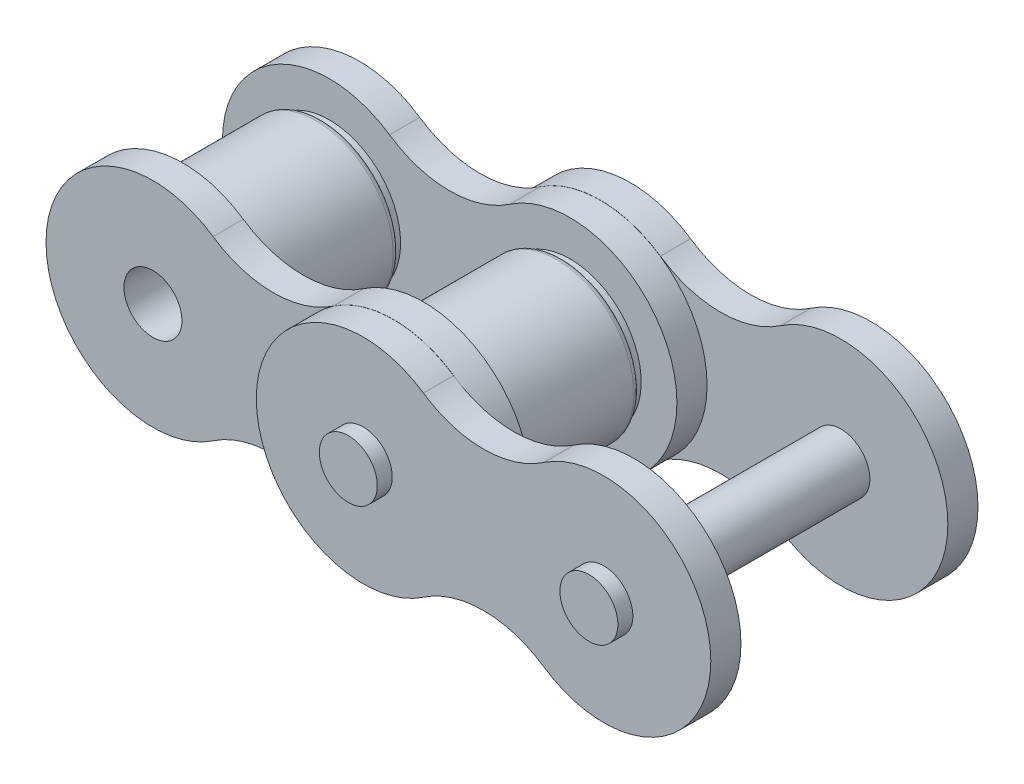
ISO-10303-21;
HEADER;
FILE_DESCRIPTION(('STEP AP214'),'2;1');
FILE_NAME('part.step','',(''),(''),'','','');
FILE_SCHEMA(('AUTOMOTIVE_DESIGN { 1 0 10303 214 1 1 1 1 }'));
ENDSEC;
DATA;
#1=APPLICATION_CONTEXT('core data for automotive mechanical design processes');
#2=APPLICATION_PROTOCOL_DEFINITION('international standard','automotive_design',2000,#1);
#3=PRODUCT_CONTEXT('',#1,'mechanical');
#4=PRODUCT('Part','Part','',(#3));
#5=PRODUCT_RELATED_PRODUCT_CATEGORY('part','',(#4));
#6=PRODUCT_DEFINITION_FORMATION('','',#4);
#7=PRODUCT_DEFINITION_CONTEXT('part definition',#1,'design');
#8=PRODUCT_DEFINITION('design','',#6,#7);
#9=PRODUCT_DEFINITION_SHAPE('','',#8);
#10=(LENGTH_UNIT() NAMED_UNIT(*) SI_UNIT(.MILLI.,.METRE.));
#11=(NAMED_UNIT(*) PLANE_ANGLE_UNIT() SI_UNIT($,.RADIAN.));
#12=(NAMED_UNIT(*) SI_UNIT($,.STERADIAN.) SOLID_ANGLE_UNIT());
#13=UNCERTAINTY_MEASURE_WITH_UNIT(LENGTH_MEASURE(1.E-05),#10,'distance_accuracy_value','');
#14=(GEOMETRIC_REPRESENTATION_CONTEXT(3) GLOBAL_UNCERTAINTY_ASSIGNED_CONTEXT((#13)) GLOBAL_UNIT_ASSIGNED_CONTEXT((#10,
#11,#12)) REPRESENTATION_CONTEXT('',''));
#15=CARTESIAN_POINT('',(0.,0.,0.));
#16=DIRECTION('',(0.,0.,1.));
#17=DIRECTION('',(1.,0.,0.));
#18=AXIS2_PLACEMENT_3D('',#15,#16,#17);
#19=CARTESIAN_POINT('',(32.70625,0.,9.8));
#20=DIRECTION('',(0.,0.,1.));
#21=DIRECTION('',(1.,0.,0.));
#22=AXIS2_PLACEMENT_3D('',#19,#20,#21);
#23=PLANE('',#22);
#24=CARTESIAN_POINT('',(31.75,0.,9.8));
#25=DIRECTION('',(0.,0.,-1.));
#26=DIRECTION('',(-1.,0.,0.));
#27=AXIS2_PLACEMENT_3D('',#24,#25,#26);
#28=CIRCLE('',#27,1.9125);
#29=CARTESIAN_POINT('',(29.8375,0.,9.8));
#30=VERTEX_POINT('',#29);
#31=EDGE_CURVE('E20',#30,#30,#28,.T.);
#32=ORIENTED_EDGE('',*,*,#31,.F.);
#33=EDGE_LOOP('',(#32));
#34=FACE_BOUND('',#33,.T.);
#35=ADVANCED_FACE('F16',(#34),#23,.T.);
#36=CARTESIAN_POINT('',(16.83125,0.,9.8));
#37=DIRECTION('',(0.,0.,1.));
#38=DIRECTION('',(1.,0.,0.));
#39=AXIS2_PLACEMENT_3D('',#36,#37,#38);
#40=PLANE('',#39);
#41=CARTESIAN_POINT('',(15.875,0.,9.8));
#42=DIRECTION('',(0.,0.,-1.));
#43=DIRECTION('',(-1.,0.,0.));
#44=AXIS2_PLACEMENT_3D('',#41,#42,#43);
#45=CIRCLE('',#44,1.9125);
#46=CARTESIAN_POINT('',(13.9625,0.,9.8));
#47=VERTEX_POINT('',#46);
#48=EDGE_CURVE('E305',#47,#47,#45,.T.);
#49=ORIENTED_EDGE('',*,*,#48,.F.);
#50=EDGE_LOOP('',(#49));
#51=FACE_BOUND('',#50,.T.);
#52=ADVANCED_FACE('F315',(#51),#40,.T.);
#53=CARTESIAN_POINT('',(31.75,0.,0.));
#54=DIRECTION('',(0.,0.,-1.));
#55=DIRECTION('',(-1.,0.,0.));
#56=AXIS2_PLACEMENT_3D('',#53,#54,#55);
#57=CYLINDRICAL_SURFACE('',#56,1.9125);
#58=CARTESIAN_POINT('',(31.75,0.,8.815));
#59=DIRECTION('',(0.,0.,-1.));
#60=DIRECTION('',(-1.,0.,0.));
#61=AXIS2_PLACEMENT_3D('',#58,#59,#60);
#62=CIRCLE('',#61,1.9125);
#63=CARTESIAN_POINT('',(29.8375,0.,8.815));
#64=VERTEX_POINT('',#63);
#65=EDGE_CURVE('E303',#64,#64,#62,.F.);
#66=ORIENTED_EDGE('',*,*,#65,.T.);
#67=EDGE_LOOP('',(#66));
#68=FACE_BOUND('',#67,.T.);
#69=ORIENTED_EDGE('',*,*,#31,.T.);
#70=EDGE_LOOP('',(#69));
#71=FACE_BOUND('',#70,.T.);
#72=ADVANCED_FACE('F312',(#68,#71),#57,.T.);
#73=CARTESIAN_POINT('',(15.875,0.,7.3125));
#74=DIRECTION('',(0.,0.,-1.));
#75=DIRECTION('',(-1.,0.,0.));
#76=AXIS2_PLACEMENT_3D('',#73,#74,#75);
#77=CYLINDRICAL_SURFACE('',#76,1.9125);
#78=ORIENTED_EDGE('',*,*,#48,.T.);
#79=EDGE_LOOP('',(#78));
#80=FACE_BOUND('',#79,.T.);
#81=CARTESIAN_POINT('',(15.875,0.,8.815));
#82=DIRECTION('',(0.,0.,-1.));
#83=DIRECTION('',(-1.,0.,0.));
#84=AXIS2_PLACEMENT_3D('',#81,#82,#83);
#85=CIRCLE('',#84,1.9125);
#86=CARTESIAN_POINT('',(13.9625,0.,8.815));
#87=VERTEX_POINT('',#86);
#88=EDGE_CURVE('E170',#87,#87,#85,.F.);
#89=ORIENTED_EDGE('',*,*,#88,.T.);
#90=EDGE_LOOP('',(#89));
#91=FACE_BOUND('',#90,.T.);
#92=ADVANCED_FACE('F657',(#80,#91),#77,.T.);
#93=CARTESIAN_POINT('',(0.,0.,8.815));
#94=DIRECTION('',(0.,0.,-1.));
#95=DIRECTION('',(-1.,0.,0.));
#96=AXIS2_PLACEMENT_3D('',#93,#94,#95);
#97=PLANE('',#96);
#98=ORIENTED_EDGE('',*,*,#88,.F.);
#99=EDGE_LOOP('',(#98));
#100=FACE_BOUND('',#99,.T.);
#101=CARTESIAN_POINT('',(15.875,0.,8.815));
#102=DIRECTION('',(0.,0.,-1.));
#103=DIRECTION('',(-1.,0.,0.));
#104=AXIS2_PLACEMENT_3D('',#101,#102,#103);
#105=CIRCLE('',#104,7.0555);
#106=CARTESIAN_POINT('',(19.84375,-5.833446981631,8.815));
#107=VERTEX_POINT('',#106);
#108=CARTESIAN_POINT('',(19.84375,5.833446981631,8.815));
#109=VERTEX_POINT('',#108);
#110=EDGE_CURVE('E127',#107,#109,#105,.T.);
#111=ORIENTED_EDGE('',*,*,#110,.F.);
#112=CARTESIAN_POINT('',(23.8125,-11.666893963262,8.815));
#113=DIRECTION('',(0.,0.,-1.));
#114=DIRECTION('',(-1.,0.,0.));
#115=AXIS2_PLACEMENT_3D('',#112,#113,#114);
#116=CIRCLE('',#115,7.05550000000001);
#117=CARTESIAN_POINT('',(27.78125,-5.833446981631,8.815));
#118=VERTEX_POINT('',#117);
#119=EDGE_CURVE('E297',#107,#118,#116,.T.);
#120=ORIENTED_EDGE('',*,*,#119,.T.);
#121=CARTESIAN_POINT('',(31.75,0.,8.815));
#122=DIRECTION('',(0.,0.,-1.));
#123=DIRECTION('',(-1.,0.,0.));
#124=AXIS2_PLACEMENT_3D('',#121,#122,#123);
#125=CIRCLE('',#124,7.0555);
#126=CARTESIAN_POINT('',(27.78125,5.833446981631,8.815));
#127=VERTEX_POINT('',#126);
#128=EDGE_CURVE('E144',#127,#118,#125,.T.);
#129=ORIENTED_EDGE('',*,*,#128,.F.);
#130=CARTESIAN_POINT('',(23.8125,11.666893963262,8.815));
#131=DIRECTION('',(0.,0.,-1.));
#132=DIRECTION('',(-1.,0.,0.));
#133=AXIS2_PLACEMENT_3D('',#130,#131,#132);
#134=CIRCLE('',#133,7.05550000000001);
#135=EDGE_CURVE('E141',#127,#109,#134,.T.);
#136=ORIENTED_EDGE('',*,*,#135,.T.);
#137=EDGE_LOOP('',(#111,#120,#129,#136));
#138=FACE_BOUND('',#137,.T.);
#139=ORIENTED_EDGE('',*,*,#65,.F.);
#140=EDGE_LOOP('',(#139));
#141=FACE_BOUND('',#140,.T.);
#142=ADVANCED_FACE('F142',(#100,#138,#141),#97,.F.);
#143=CARTESIAN_POINT('',(32.70625,0.,-9.79999999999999));
#144=DIRECTION('',(0.,0.,-1.));
#145=DIRECTION('',(-1.,0.,0.));
#146=AXIS2_PLACEMENT_3D('',#143,#144,#145);
#147=PLANE('',#146);
#148=CARTESIAN_POINT('',(31.75,0.,-9.8));
#149=DIRECTION('',(0.,0.,-1.));
#150=DIRECTION('',(-1.,0.,0.));
#151=AXIS2_PLACEMENT_3D('',#148,#149,#150);
#152=CIRCLE('',#151,1.9125);
#153=CARTESIAN_POINT('',(29.8375,0.,-9.8));
#154=VERTEX_POINT('',#153);
#155=EDGE_CURVE('E294',#154,#154,#152,.F.);
#156=ORIENTED_EDGE('',*,*,#155,.F.);
#157=EDGE_LOOP('',(#156));
#158=FACE_BOUND('',#157,.T.);
#159=ADVANCED_FACE('F641',(#158),#147,.T.);
#160=CARTESIAN_POINT('',(16.83125,0.,-9.8));
#161=DIRECTION('',(0.,0.,-1.));
#162=DIRECTION('',(-1.,0.,0.));
#163=AXIS2_PLACEMENT_3D('',#160,#161,#162);
#164=PLANE('',#163);
#165=CARTESIAN_POINT('',(15.875,0.,-9.8));
#166=DIRECTION('',(0.,0.,-1.));
#167=DIRECTION('',(-1.,0.,0.));
#168=AXIS2_PLACEMENT_3D('',#165,#166,#167);
#169=CIRCLE('',#168,1.9125);
#170=CARTESIAN_POINT('',(13.9625,0.,-9.8));
#171=VERTEX_POINT('',#170);
#172=EDGE_CURVE('E165',#171,#171,#169,.F.);
#173=ORIENTED_EDGE('',*,*,#172,.F.);
#174=EDGE_LOOP('',(#173));
#175=FACE_BOUND('',#174,.T.);
#176=ADVANCED_FACE('F633',(#175),#164,.T.);
#177=CARTESIAN_POINT('',(0.,0.,3.943));
#178=DIRECTION('',(0.,0.,1.));
#179=DIRECTION('',(-1.,0.,0.));
#180=AXIS2_PLACEMENT_3D('',#177,#178,#179);
#181=TOROIDAL_SURFACE('',#180,4.7,0.4);
#182=CARTESIAN_POINT('',(0.,0.,4.343));
#183=DIRECTION('',(0.,0.,-1.));
#184=DIRECTION('',(-1.,0.,0.));
#185=AXIS2_PLACEMENT_3D('',#182,#183,#184);
#186=CIRCLE('',#185,4.7);
#187=CARTESIAN_POINT('',(-4.7,0.,4.343));
#188=VERTEX_POINT('',#187);
#189=EDGE_CURVE('E138',#188,#188,#186,.F.);
#190=ORIENTED_EDGE('',*,*,#189,.F.);
#191=EDGE_LOOP('',(#190));
#192=FACE_BOUND('',#191,.T.);
#193=CARTESIAN_POINT('',(0.,0.,3.943));
#194=DIRECTION('',(0.,0.,-1.));
#195=DIRECTION('',(-1.,0.,0.));
#196=AXIS2_PLACEMENT_3D('',#193,#194,#195);
#197=CIRCLE('',#196,5.1);
#198=CARTESIAN_POINT('',(-5.1,0.,3.943));
#199=VERTEX_POINT('',#198);
#200=EDGE_CURVE('E162',#199,#199,#197,.T.);
#201=ORIENTED_EDGE('',*,*,#200,.F.);
#202=EDGE_LOOP('',(#201));
#203=FACE_BOUND('',#202,.T.);
#204=ADVANCED_FACE('F541',(#192,#203),#181,.T.);
#205=CARTESIAN_POINT('',(15.875,0.,3.94299999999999));
#206=DIRECTION('',(0.,0.,1.));
#207=DIRECTION('',(-1.,0.,0.));
#208=AXIS2_PLACEMENT_3D('',#205,#206,#207);
#209=TOROIDAL_SURFACE('',#208,4.7,0.400000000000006);
#210=CARTESIAN_POINT('',(15.875,0.,3.943));
#211=DIRECTION('',(0.,0.,-1.));
#212=DIRECTION('',(-1.,0.,0.));
#213=AXIS2_PLACEMENT_3D('',#210,#211,#212);
#214=CIRCLE('',#213,5.1);
#215=CARTESIAN_POINT('',(10.775,0.,3.943));
#216=VERTEX_POINT('',#215);
#217=EDGE_CURVE('E158',#216,#216,#214,.T.);
#218=ORIENTED_EDGE('',*,*,#217,.F.);
#219=EDGE_LOOP('',(#218));
#220=FACE_BOUND('',#219,.T.);
#221=CARTESIAN_POINT('',(15.875,0.,4.343));
#222=DIRECTION('',(0.,0.,-1.));
#223=DIRECTION('',(-1.,0.,0.));
#224=AXIS2_PLACEMENT_3D('',#221,#222,#223);
#225=CIRCLE('',#224,4.7);
#226=CARTESIAN_POINT('',(11.175,0.,4.343));
#227=VERTEX_POINT('',#226);
#228=EDGE_CURVE('E168',#227,#227,#225,.F.);
#229=ORIENTED_EDGE('',*,*,#228,.F.);
#230=EDGE_LOOP('',(#229));
#231=FACE_BOUND('',#230,.T.);
#232=ADVANCED_FACE('F536',(#220,#231),#209,.T.);
#233=CARTESIAN_POINT('',(15.875,0.,4.584));
#234=DIRECTION('',(0.,0.,-1.));
#235=DIRECTION('',(-1.,0.,0.));
#236=AXIS2_PLACEMENT_3D('',#233,#234,#235);
#237=CYLINDRICAL_SURFACE('',#236,4.7);
#238=CARTESIAN_POINT('',(15.875,0.,4.825));
#239=DIRECTION('',(0.,0.,-1.));
#240=DIRECTION('',(-1.,0.,0.));
#241=AXIS2_PLACEMENT_3D('',#238,#239,#240);
#242=CIRCLE('',#241,4.7);
#243=CARTESIAN_POINT('',(11.175,0.,4.825));
#244=VERTEX_POINT('',#243);
#245=EDGE_CURVE('E161',#244,#244,#242,.F.);
#246=ORIENTED_EDGE('',*,*,#245,.F.);
#247=EDGE_LOOP('',(#246));
#248=FACE_BOUND('',#247,.T.);
#249=ORIENTED_EDGE('',*,*,#228,.T.);
#250=EDGE_LOOP('',(#249));
#251=FACE_BOUND('',#250,.T.);
#252=ADVANCED_FACE('F540',(#248,#251),#237,.T.);
#253=CARTESIAN_POINT('',(0.,0.,4.584));
#254=DIRECTION('',(0.,0.,-1.));
#255=DIRECTION('',(-1.,0.,0.));
#256=AXIS2_PLACEMENT_3D('',#253,#254,#255);
#257=CYLINDRICAL_SURFACE('',#256,4.7);
#258=CARTESIAN_POINT('',(0.,0.,4.825));
#259=DIRECTION('',(0.,0.,-1.));
#260=DIRECTION('',(-1.,0.,0.));
#261=AXIS2_PLACEMENT_3D('',#258,#259,#260);
#262=CIRCLE('',#261,4.7);
#263=CARTESIAN_POINT('',(-4.7,0.,4.825));
#264=VERTEX_POINT('',#263);
#265=EDGE_CURVE('E287',#264,#264,#262,.F.);
#266=ORIENTED_EDGE('',*,*,#265,.F.);
#267=EDGE_LOOP('',(#266));
#268=FACE_BOUND('',#267,.T.);
#269=ORIENTED_EDGE('',*,*,#189,.T.);
#270=EDGE_LOOP('',(#269));
#271=FACE_BOUND('',#270,.T.);
#272=ADVANCED_FACE('F546',(#268,#271),#257,.T.);
#273=CARTESIAN_POINT('',(15.875,0.,6.825));
#274=DIRECTION('',(0.,0.,-1.));
#275=DIRECTION('',(-1.,0.,0.));
#276=AXIS2_PLACEMENT_3D('',#273,#274,#275);
#277=CYLINDRICAL_SURFACE('',#276,7.0555);
#278=DIRECTION('',(0.,0.,-1.));
#279=VECTOR('',#278,1.);
#280=CARTESIAN_POINT('',(19.84375,5.83344698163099,6.825));
#281=LINE('',#280,#279);
#282=CARTESIAN_POINT('',(19.84375,5.83344698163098,6.825));
#283=VERTEX_POINT('',#282);
#284=EDGE_CURVE('E131',#109,#283,#281,.T.);
#285=ORIENTED_EDGE('',*,*,#284,.T.);
#286=CARTESIAN_POINT('',(15.875,0.,6.825));
#287=DIRECTION('',(0.,0.,-1.));
#288=DIRECTION('',(-1.,0.,0.));
#289=AXIS2_PLACEMENT_3D('',#286,#287,#288);
#290=CIRCLE('',#289,7.0555);
#291=CARTESIAN_POINT('',(19.84375,-5.833446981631,6.825));
#292=VERTEX_POINT('',#291);
#293=EDGE_CURVE('E285',#292,#283,#290,.T.);
#294=ORIENTED_EDGE('',*,*,#293,.F.);
#295=DIRECTION('',(0.,0.,-1.));
#296=VECTOR('',#295,1.);
#297=CARTESIAN_POINT('',(19.84375,-5.83344698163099,6.825));
#298=LINE('',#297,#296);
#299=EDGE_CURVE('E134',#292,#107,#298,.F.);
#300=ORIENTED_EDGE('',*,*,#299,.T.);
#301=ORIENTED_EDGE('',*,*,#110,.T.);
#302=EDGE_LOOP('',(#285,#294,#300,#301));
#303=FACE_BOUND('',#302,.T.);
#304=ADVANCED_FACE('F129',(#303),#277,.T.);
#305=CARTESIAN_POINT('',(23.8125,11.666893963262,6.825));
#306=DIRECTION('',(0.,0.,-1.));
#307=DIRECTION('',(-1.,0.,0.));
#308=AXIS2_PLACEMENT_3D('',#305,#306,#307);
#309=CYLINDRICAL_SURFACE('',#308,7.05550000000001);
#310=DIRECTION('',(0.,0.,-1.));
#311=VECTOR('',#310,1.);
#312=CARTESIAN_POINT('',(27.78125,5.83344698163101,6.825));
#313=LINE('',#312,#311);
#314=CARTESIAN_POINT('',(27.78125,5.83344698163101,6.825));
#315=VERTEX_POINT('',#314);
#316=EDGE_CURVE('E148',#315,#127,#313,.F.);
#317=ORIENTED_EDGE('',*,*,#316,.F.);
#318=CARTESIAN_POINT('',(23.8125,11.666893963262,6.825));
#319=DIRECTION('',(0.,0.,-1.));
#320=DIRECTION('',(-1.,0.,0.));
#321=AXIS2_PLACEMENT_3D('',#318,#319,#320);
#322=CIRCLE('',#321,7.05550000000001);
#323=EDGE_CURVE('E152',#283,#315,#322,.F.);
#324=ORIENTED_EDGE('',*,*,#323,.F.);
#325=ORIENTED_EDGE('',*,*,#284,.F.);
#326=ORIENTED_EDGE('',*,*,#135,.F.);
#327=EDGE_LOOP('',(#317,#324,#325,#326));
#328=FACE_BOUND('',#327,.T.);
#329=ADVANCED_FACE('F150',(#328),#309,.F.);
#330=CARTESIAN_POINT('',(31.75,0.,6.825));
#331=DIRECTION('',(0.,0.,-1.));
#332=DIRECTION('',(-1.,0.,0.));
#333=AXIS2_PLACEMENT_3D('',#330,#331,#332);
#334=CYLINDRICAL_SURFACE('',#333,7.0555);
#335=DIRECTION('',(0.,0.,-1.));
#336=VECTOR('',#335,1.);
#337=CARTESIAN_POINT('',(27.78125,-5.83344698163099,6.825));
#338=LINE('',#337,#336);
#339=CARTESIAN_POINT('',(27.78125,-5.83344698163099,6.825));
#340=VERTEX_POINT('',#339);
#341=EDGE_CURVE('E299',#118,#340,#338,.T.);
#342=ORIENTED_EDGE('',*,*,#341,.T.);
#343=CARTESIAN_POINT('',(31.75,0.,6.825));
#344=DIRECTION('',(0.,0.,-1.));
#345=DIRECTION('',(-1.,0.,0.));
#346=AXIS2_PLACEMENT_3D('',#343,#344,#345);
#347=CIRCLE('',#346,7.0555);
#348=EDGE_CURVE('E281',#315,#340,#347,.T.);
#349=ORIENTED_EDGE('',*,*,#348,.F.);
#350=ORIENTED_EDGE('',*,*,#316,.T.);
#351=ORIENTED_EDGE('',*,*,#128,.T.);
#352=EDGE_LOOP('',(#342,#349,#350,#351));
#353=FACE_BOUND('',#352,.T.);
#354=ADVANCED_FACE('F407',(#353),#334,.T.);
#355=CARTESIAN_POINT('',(23.8125,-11.666893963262,6.825));
#356=DIRECTION('',(0.,0.,-1.));
#357=DIRECTION('',(-1.,0.,0.));
#358=AXIS2_PLACEMENT_3D('',#355,#356,#357);
#359=CYLINDRICAL_SURFACE('',#358,7.05550000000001);
#360=ORIENTED_EDGE('',*,*,#299,.F.);
#361=CARTESIAN_POINT('',(23.8125,-11.666893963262,6.825));
#362=DIRECTION('',(0.,0.,-1.));
#363=DIRECTION('',(-1.,0.,0.));
#364=AXIS2_PLACEMENT_3D('',#361,#362,#363);
#365=CIRCLE('',#364,7.05550000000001);
#366=EDGE_CURVE('E278',#340,#292,#365,.F.);
#367=ORIENTED_EDGE('',*,*,#366,.F.);
#368=ORIENTED_EDGE('',*,*,#341,.F.);
#369=ORIENTED_EDGE('',*,*,#119,.F.);
#370=EDGE_LOOP('',(#360,#367,#368,#369));
#371=FACE_BOUND('',#370,.T.);
#372=ADVANCED_FACE('F409',(#371),#359,.F.);
#373=CARTESIAN_POINT('',(31.75,0.,0.));
#374=DIRECTION('',(0.,0.,-1.));
#375=DIRECTION('',(-1.,0.,0.));
#376=AXIS2_PLACEMENT_3D('',#373,#374,#375);
#377=CYLINDRICAL_SURFACE('',#376,1.9125);
#378=ORIENTED_EDGE('',*,*,#155,.T.);
#379=EDGE_LOOP('',(#378));
#380=FACE_BOUND('',#379,.T.);
#381=CARTESIAN_POINT('',(31.75,0.,-8.815));
#382=DIRECTION('',(0.,0.,-1.));
#383=DIRECTION('',(-1.,0.,0.));
#384=AXIS2_PLACEMENT_3D('',#381,#382,#383);
#385=CIRCLE('',#384,1.9125);
#386=CARTESIAN_POINT('',(29.8375,0.,-8.815));
#387=VERTEX_POINT('',#386);
#388=EDGE_CURVE('E275',#387,#387,#385,.F.);
#389=ORIENTED_EDGE('',*,*,#388,.F.);
#390=EDGE_LOOP('',(#389));
#391=FACE_BOUND('',#390,.T.);
#392=ADVANCED_FACE('F487',(#380,#391),#377,.T.);
#393=CARTESIAN_POINT('',(15.875,0.,-7.3125));
#394=DIRECTION('',(0.,0.,-1.));
#395=DIRECTION('',(-1.,0.,0.));
#396=AXIS2_PLACEMENT_3D('',#393,#394,#395);
#397=CYLINDRICAL_SURFACE('',#396,1.9125);
#398=CARTESIAN_POINT('',(15.875,0.,-8.815));
#399=DIRECTION('',(0.,0.,-1.));
#400=DIRECTION('',(-1.,0.,0.));
#401=AXIS2_PLACEMENT_3D('',#398,#399,#400);
#402=CIRCLE('',#401,1.9125);
#403=CARTESIAN_POINT('',(13.9625,0.,-8.815));
#404=VERTEX_POINT('',#403);
#405=EDGE_CURVE('E271',#404,#404,#402,.F.);
#406=ORIENTED_EDGE('',*,*,#405,.F.);
#407=EDGE_LOOP('',(#406));
#408=FACE_BOUND('',#407,.T.);
#409=ORIENTED_EDGE('',*,*,#172,.T.);
#410=EDGE_LOOP('',(#409));
#411=FACE_BOUND('',#410,.T.);
#412=ADVANCED_FACE('F489',(#408,#411),#397,.T.);
#413=CARTESIAN_POINT('',(0.,0.,0.));
#414=DIRECTION('',(0.,0.,-1.));
#415=DIRECTION('',(-1.,0.,0.));
#416=AXIS2_PLACEMENT_3D('',#413,#414,#415);
#417=CYLINDRICAL_SURFACE('',#416,5.1);
#418=CARTESIAN_POINT('',(0.,0.,-3.943));
#419=DIRECTION('',(0.,0.,1.));
#420=DIRECTION('',(-1.,0.,0.));
#421=AXIS2_PLACEMENT_3D('',#418,#419,#420);
#422=CIRCLE('',#421,5.1);
#423=CARTESIAN_POINT('',(-5.1,0.,-3.943));
#424=VERTEX_POINT('',#423);
#425=EDGE_CURVE('E274',#424,#424,#422,.F.);
#426=ORIENTED_EDGE('',*,*,#425,.F.);
#427=EDGE_LOOP('',(#426));
#428=FACE_BOUND('',#427,.T.);
#429=ORIENTED_EDGE('',*,*,#200,.T.);
#430=EDGE_LOOP('',(#429));
#431=FACE_BOUND('',#430,.T.);
#432=ADVANCED_FACE('F497',(#428,#431),#417,.T.);
#433=CARTESIAN_POINT('',(15.875,0.,0.));
#434=DIRECTION('',(0.,0.,-1.));
#435=DIRECTION('',(-1.,0.,0.));
#436=AXIS2_PLACEMENT_3D('',#433,#434,#435);
#437=CYLINDRICAL_SURFACE('',#436,5.1);
#438=ORIENTED_EDGE('',*,*,#217,.T.);
#439=EDGE_LOOP('',(#438));
#440=FACE_BOUND('',#439,.T.);
#441=CARTESIAN_POINT('',(15.875,0.,-3.94299999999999));
#442=DIRECTION('',(0.,0.,1.));
#443=DIRECTION('',(-1.,0.,0.));
#444=AXIS2_PLACEMENT_3D('',#441,#442,#443);
#445=CIRCLE('',#444,5.10000000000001);
#446=CARTESIAN_POINT('',(10.775,0.,-3.94299999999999));
#447=VERTEX_POINT('',#446);
#448=EDGE_CURVE('E270',#447,#447,#445,.F.);
#449=ORIENTED_EDGE('',*,*,#448,.F.);
#450=EDGE_LOOP('',(#449));
#451=FACE_BOUND('',#450,.T.);
#452=ADVANCED_FACE('F505',(#440,#451),#437,.T.);
#453=CARTESIAN_POINT('',(0.,0.,4.825));
#454=DIRECTION('',(0.,0.,-1.));
#455=DIRECTION('',(-1.,0.,0.));
#456=AXIS2_PLACEMENT_3D('',#453,#454,#455);
#457=PLANE('',#456);
#458=ORIENTED_EDGE('',*,*,#265,.T.);
#459=EDGE_LOOP('',(#458));
#460=FACE_BOUND('',#459,.T.);
#461=CARTESIAN_POINT('',(15.875,0.,4.825));
#462=DIRECTION('',(0.,0.,-1.));
#463=DIRECTION('',(-1.,0.,0.));
#464=AXIS2_PLACEMENT_3D('',#461,#462,#463);
#465=CIRCLE('',#464,7.0555);
#466=CARTESIAN_POINT('',(11.90625,-5.833446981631,4.825));
#467=VERTEX_POINT('',#466);
#468=CARTESIAN_POINT('',(11.90625,5.83344698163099,4.825));
#469=VERTEX_POINT('',#468);
#470=EDGE_CURVE('E265',#467,#469,#465,.F.);
#471=ORIENTED_EDGE('',*,*,#470,.F.);
#472=CARTESIAN_POINT('',(7.9375,-11.666893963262,4.825));
#473=DIRECTION('',(0.,0.,-1.));
#474=DIRECTION('',(-1.,0.,0.));
#475=AXIS2_PLACEMENT_3D('',#472,#473,#474);
#476=CIRCLE('',#475,7.0555);
#477=CARTESIAN_POINT('',(3.96875,-5.833446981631,4.825));
#478=VERTEX_POINT('',#477);
#479=EDGE_CURVE('E261',#467,#478,#476,.F.);
#480=ORIENTED_EDGE('',*,*,#479,.T.);
#481=CARTESIAN_POINT('',(0.,0.,4.825));
#482=DIRECTION('',(0.,0.,-1.));
#483=DIRECTION('',(-1.,0.,0.));
#484=AXIS2_PLACEMENT_3D('',#481,#482,#483);
#485=CIRCLE('',#484,7.0555);
#486=CARTESIAN_POINT('',(3.96875,5.833446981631,4.825));
#487=VERTEX_POINT('',#486);
#488=EDGE_CURVE('E258',#487,#478,#485,.F.);
#489=ORIENTED_EDGE('',*,*,#488,.F.);
#490=CARTESIAN_POINT('',(7.9375,11.666893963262,4.825));
#491=DIRECTION('',(0.,0.,-1.));
#492=DIRECTION('',(-1.,0.,0.));
#493=AXIS2_PLACEMENT_3D('',#490,#491,#492);
#494=CIRCLE('',#493,7.05550000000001);
#495=EDGE_CURVE('E254',#487,#469,#494,.F.);
#496=ORIENTED_EDGE('',*,*,#495,.T.);
#497=EDGE_LOOP('',(#471,#480,#489,#496));
#498=FACE_BOUND('',#497,.T.);
#499=ORIENTED_EDGE('',*,*,#245,.T.);
#500=EDGE_LOOP('',(#499));
#501=FACE_BOUND('',#500,.T.);
#502=ADVANCED_FACE('F415',(#460,#498,#501),#457,.T.);
#503=CARTESIAN_POINT('',(0.,0.,6.825));
#504=DIRECTION('',(0.,0.,-1.));
#505=DIRECTION('',(-1.,0.,0.));
#506=AXIS2_PLACEMENT_3D('',#503,#504,#505);
#507=PLANE('',#506);
#508=CARTESIAN_POINT('',(15.875,0.,6.825));
#509=DIRECTION('',(0.,0.,-1.));
#510=DIRECTION('',(-1.,0.,0.));
#511=AXIS2_PLACEMENT_3D('',#508,#509,#510);
#512=CIRCLE('',#511,1.9125);
#513=CARTESIAN_POINT('',(13.9625,0.,6.825));
#514=VERTEX_POINT('',#513);
#515=EDGE_CURVE('E267',#514,#514,#512,.T.);
#516=ORIENTED_EDGE('',*,*,#515,.F.);
#517=EDGE_LOOP('',(#516));
#518=FACE_BOUND('',#517,.T.);
#519=ORIENTED_EDGE('',*,*,#348,.T.);
#520=ORIENTED_EDGE('',*,*,#366,.T.);
#521=ORIENTED_EDGE('',*,*,#293,.T.);
#522=ORIENTED_EDGE('',*,*,#323,.T.);
#523=EDGE_LOOP('',(#519,#520,#521,#522));
#524=FACE_BOUND('',#523,.T.);
#525=CARTESIAN_POINT('',(31.75,0.,6.825));
#526=DIRECTION('',(0.,0.,-1.));
#527=DIRECTION('',(-1.,0.,0.));
#528=AXIS2_PLACEMENT_3D('',#525,#526,#527);
#529=CIRCLE('',#528,1.9125);
#530=CARTESIAN_POINT('',(29.8375,0.,6.825));
#531=VERTEX_POINT('',#530);
#532=EDGE_CURVE('E250',#531,#531,#529,.T.);
#533=ORIENTED_EDGE('',*,*,#532,.F.);
#534=EDGE_LOOP('',(#533));
#535=FACE_BOUND('',#534,.T.);
#536=ADVANCED_FACE('F411',(#518,#524,#535),#507,.T.);
#537=CARTESIAN_POINT('',(0.,0.,-8.815));
#538=DIRECTION('',(0.,0.,-1.));
#539=DIRECTION('',(-1.,0.,0.));
#540=AXIS2_PLACEMENT_3D('',#537,#538,#539);
#541=PLANE('',#540);
#542=ORIENTED_EDGE('',*,*,#405,.T.);
#543=EDGE_LOOP('',(#542));
#544=FACE_BOUND('',#543,.T.);
#545=CARTESIAN_POINT('',(23.8125,11.666893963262,-8.815));
#546=DIRECTION('',(0.,0.,1.));
#547=DIRECTION('',(1.,0.,0.));
#548=AXIS2_PLACEMENT_3D('',#545,#546,#547);
#549=CIRCLE('',#548,7.05550000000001);
#550=CARTESIAN_POINT('',(19.84375,5.833446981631,-8.815));
#551=VERTEX_POINT('',#550);
#552=CARTESIAN_POINT('',(27.78125,5.833446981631,-8.815));
#553=VERTEX_POINT('',#552);
#554=EDGE_CURVE('E246',#551,#553,#549,.T.);
#555=ORIENTED_EDGE('',*,*,#554,.T.);
#556=CARTESIAN_POINT('',(31.75,0.,-8.815));
#557=DIRECTION('',(0.,0.,1.));
#558=DIRECTION('',(1.,0.,0.));
#559=AXIS2_PLACEMENT_3D('',#556,#557,#558);
#560=CIRCLE('',#559,7.0555);
#561=CARTESIAN_POINT('',(27.78125,-5.833446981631,-8.815));
#562=VERTEX_POINT('',#561);
#563=EDGE_CURVE('E243',#562,#553,#560,.T.);
#564=ORIENTED_EDGE('',*,*,#563,.F.);
#565=CARTESIAN_POINT('',(23.8125,-11.666893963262,-8.815));
#566=DIRECTION('',(0.,0.,1.));
#567=DIRECTION('',(1.,0.,0.));
#568=AXIS2_PLACEMENT_3D('',#565,#566,#567);
#569=CIRCLE('',#568,7.05550000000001);
#570=CARTESIAN_POINT('',(19.84375,-5.833446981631,-8.815));
#571=VERTEX_POINT('',#570);
#572=EDGE_CURVE('E240',#562,#571,#569,.T.);
#573=ORIENTED_EDGE('',*,*,#572,.T.);
#574=CARTESIAN_POINT('',(15.875,0.,-8.815));
#575=DIRECTION('',(0.,0.,1.));
#576=DIRECTION('',(1.,0.,0.));
#577=AXIS2_PLACEMENT_3D('',#574,#575,#576);
#578=CIRCLE('',#577,7.0555);
#579=EDGE_CURVE('E236',#551,#571,#578,.T.);
#580=ORIENTED_EDGE('',*,*,#579,.F.);
#581=EDGE_LOOP('',(#555,#564,#573,#580));
#582=FACE_BOUND('',#581,.T.);
#583=ORIENTED_EDGE('',*,*,#388,.T.);
#584=EDGE_LOOP('',(#583));
#585=FACE_BOUND('',#584,.T.);
#586=ADVANCED_FACE('F414',(#544,#582,#585),#541,.T.);
#587=CARTESIAN_POINT('',(0.,0.,-3.943));
#588=DIRECTION('',(0.,0.,1.));
#589=DIRECTION('',(-1.,0.,0.));
#590=AXIS2_PLACEMENT_3D('',#587,#588,#589);
#591=TOROIDAL_SURFACE('',#590,4.7,0.4);
#592=ORIENTED_EDGE('',*,*,#425,.T.);
#593=EDGE_LOOP('',(#592));
#594=FACE_BOUND('',#593,.T.);
#595=CARTESIAN_POINT('',(0.,0.,-4.343));
#596=DIRECTION('',(0.,0.,-1.));
#597=DIRECTION('',(-1.,0.,0.));
#598=AXIS2_PLACEMENT_3D('',#595,#596,#597);
#599=CIRCLE('',#598,4.7);
#600=CARTESIAN_POINT('',(-4.7,0.,-4.343));
#601=VERTEX_POINT('',#600);
#602=EDGE_CURVE('E381',#601,#601,#599,.T.);
#603=ORIENTED_EDGE('',*,*,#602,.F.);
#604=EDGE_LOOP('',(#603));
#605=FACE_BOUND('',#604,.T.);
#606=ADVANCED_FACE('F482',(#594,#605),#591,.T.);
#607=CARTESIAN_POINT('',(15.875,0.,-3.94299999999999));
#608=DIRECTION('',(0.,0.,1.));
#609=DIRECTION('',(-1.,0.,0.));
#610=AXIS2_PLACEMENT_3D('',#607,#608,#609);
#611=TOROIDAL_SURFACE('',#610,4.7,0.400000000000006);
#612=CARTESIAN_POINT('',(15.875,0.,-4.343));
#613=DIRECTION('',(0.,0.,-1.));
#614=DIRECTION('',(-1.,0.,0.));
#615=AXIS2_PLACEMENT_3D('',#612,#613,#614);
#616=CIRCLE('',#615,4.7);
#617=CARTESIAN_POINT('',(11.175,0.,-4.343));
#618=VERTEX_POINT('',#617);
#619=EDGE_CURVE('E235',#618,#618,#616,.T.);
#620=ORIENTED_EDGE('',*,*,#619,.F.);
#621=EDGE_LOOP('',(#620));
#622=FACE_BOUND('',#621,.T.);
#623=ORIENTED_EDGE('',*,*,#448,.T.);
#624=EDGE_LOOP('',(#623));
#625=FACE_BOUND('',#624,.T.);
#626=ADVANCED_FACE('F516',(#622,#625),#611,.T.);
#627=CARTESIAN_POINT('',(15.875,0.,7.3125));
#628=DIRECTION('',(0.,0.,-1.));
#629=DIRECTION('',(-1.,0.,0.));
#630=AXIS2_PLACEMENT_3D('',#627,#628,#629);
#631=CYLINDRICAL_SURFACE('',#630,1.9125);
#632=CARTESIAN_POINT('',(15.875,0.,6.815));
#633=DIRECTION('',(0.,0.,-1.));
#634=DIRECTION('',(-1.,0.,0.));
#635=AXIS2_PLACEMENT_3D('',#632,#633,#634);
#636=CIRCLE('',#635,1.9125);
#637=CARTESIAN_POINT('',(13.9625,0.,6.815));
#638=VERTEX_POINT('',#637);
#639=EDGE_CURVE('E232',#638,#638,#636,.F.);
#640=ORIENTED_EDGE('',*,*,#639,.T.);
#641=EDGE_LOOP('',(#640));
#642=FACE_BOUND('',#641,.T.);
#643=ORIENTED_EDGE('',*,*,#515,.T.);
#644=EDGE_LOOP('',(#643));
#645=FACE_BOUND('',#644,.T.);
#646=ADVANCED_FACE('F788',(#642,#645),#631,.T.);
#647=CARTESIAN_POINT('',(15.875,0.,4.825));
#648=DIRECTION('',(0.,0.,-1.));
#649=DIRECTION('',(-1.,0.,0.));
#650=AXIS2_PLACEMENT_3D('',#647,#648,#649);
#651=CYLINDRICAL_SURFACE('',#650,7.0555);
#652=DIRECTION('',(0.,0.,-1.));
#653=VECTOR('',#652,1.);
#654=CARTESIAN_POINT('',(11.90625,-5.833446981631,4.825));
#655=LINE('',#654,#653);
#656=CARTESIAN_POINT('',(11.90625,-5.833446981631,6.815));
#657=VERTEX_POINT('',#656);
#658=EDGE_CURVE('E264',#657,#467,#655,.T.);
#659=ORIENTED_EDGE('',*,*,#658,.T.);
#660=ORIENTED_EDGE('',*,*,#470,.T.);
#661=DIRECTION('',(0.,0.,-1.));
#662=VECTOR('',#661,1.);
#663=CARTESIAN_POINT('',(11.90625,5.83344698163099,4.825));
#664=LINE('',#663,#662);
#665=CARTESIAN_POINT('',(11.90625,5.83344698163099,6.815));
#666=VERTEX_POINT('',#665);
#667=EDGE_CURVE('E253',#469,#666,#664,.F.);
#668=ORIENTED_EDGE('',*,*,#667,.T.);
#669=CARTESIAN_POINT('',(15.875,0.,6.815));
#670=DIRECTION('',(0.,0.,-1.));
#671=DIRECTION('',(-1.,0.,0.));
#672=AXIS2_PLACEMENT_3D('',#669,#670,#671);
#673=CIRCLE('',#672,7.0555);
#674=EDGE_CURVE('E230',#666,#657,#673,.T.);
#675=ORIENTED_EDGE('',*,*,#674,.T.);
#676=EDGE_LOOP('',(#659,#660,#668,#675));
#677=FACE_BOUND('',#676,.T.);
#678=ADVANCED_FACE('F779',(#677),#651,.T.);
#679=CARTESIAN_POINT('',(7.9375,-11.666893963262,4.825));
#680=DIRECTION('',(0.,0.,-1.));
#681=DIRECTION('',(-1.,0.,0.));
#682=AXIS2_PLACEMENT_3D('',#679,#680,#681);
#683=CYLINDRICAL_SURFACE('',#682,7.0555);
#684=DIRECTION('',(0.,0.,-1.));
#685=VECTOR('',#684,1.);
#686=CARTESIAN_POINT('',(3.96875,-5.83344698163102,4.825));
#687=LINE('',#686,#685);
#688=CARTESIAN_POINT('',(3.96875,-5.833446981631,6.815));
#689=VERTEX_POINT('',#688);
#690=EDGE_CURVE('E260',#478,#689,#687,.F.);
#691=ORIENTED_EDGE('',*,*,#690,.F.);
#692=ORIENTED_EDGE('',*,*,#479,.F.);
#693=ORIENTED_EDGE('',*,*,#658,.F.);
#694=CARTESIAN_POINT('',(7.9375,-11.666893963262,6.815));
#695=DIRECTION('',(0.,0.,-1.));
#696=DIRECTION('',(-1.,0.,0.));
#697=AXIS2_PLACEMENT_3D('',#694,#695,#696);
#698=CIRCLE('',#697,7.0555);
#699=EDGE_CURVE('E227',#657,#689,#698,.F.);
#700=ORIENTED_EDGE('',*,*,#699,.T.);
#701=EDGE_LOOP('',(#691,#692,#693,#700));
#702=FACE_BOUND('',#701,.T.);
#703=ADVANCED_FACE('F772',(#702),#683,.F.);
#704=CARTESIAN_POINT('',(0.,0.,4.825));
#705=DIRECTION('',(0.,0.,-1.));
#706=DIRECTION('',(-1.,0.,0.));
#707=AXIS2_PLACEMENT_3D('',#704,#705,#706);
#708=CYLINDRICAL_SURFACE('',#707,7.0555);
#709=DIRECTION('',(0.,0.,-1.));
#710=VECTOR('',#709,1.);
#711=CARTESIAN_POINT('',(3.96874999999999,5.83344698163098,4.825));
#712=LINE('',#711,#710);
#713=CARTESIAN_POINT('',(3.96875,5.833446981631,6.815));
#714=VERTEX_POINT('',#713);
#715=EDGE_CURVE('E257',#714,#487,#712,.T.);
#716=ORIENTED_EDGE('',*,*,#715,.T.);
#717=ORIENTED_EDGE('',*,*,#488,.T.);
#718=ORIENTED_EDGE('',*,*,#690,.T.);
#719=CARTESIAN_POINT('',(0.,0.,6.815));
#720=DIRECTION('',(0.,0.,-1.));
#721=DIRECTION('',(-1.,0.,0.));
#722=AXIS2_PLACEMENT_3D('',#719,#720,#721);
#723=CIRCLE('',#722,7.0555);
#724=EDGE_CURVE('E225',#689,#714,#723,.T.);
#725=ORIENTED_EDGE('',*,*,#724,.T.);
#726=EDGE_LOOP('',(#716,#717,#718,#725));
#727=FACE_BOUND('',#726,.T.);
#728=ADVANCED_FACE('F434',(#727),#708,.T.);
#729=CARTESIAN_POINT('',(7.9375,11.666893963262,4.825));
#730=DIRECTION('',(0.,0.,-1.));
#731=DIRECTION('',(-1.,0.,0.));
#732=AXIS2_PLACEMENT_3D('',#729,#730,#731);
#733=CYLINDRICAL_SURFACE('',#732,7.05550000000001);
#734=ORIENTED_EDGE('',*,*,#667,.F.);
#735=ORIENTED_EDGE('',*,*,#495,.F.);
#736=ORIENTED_EDGE('',*,*,#715,.F.);
#737=CARTESIAN_POINT('',(7.9375,11.666893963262,6.815));
#738=DIRECTION('',(0.,0.,-1.));
#739=DIRECTION('',(-1.,0.,0.));
#740=AXIS2_PLACEMENT_3D('',#737,#738,#739);
#741=CIRCLE('',#740,7.05550000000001);
#742=EDGE_CURVE('E222',#714,#666,#741,.F.);
#743=ORIENTED_EDGE('',*,*,#742,.T.);
#744=EDGE_LOOP('',(#734,#735,#736,#743));
#745=FACE_BOUND('',#744,.T.);
#746=ADVANCED_FACE('F423',(#745),#733,.F.);
#747=CARTESIAN_POINT('',(31.75,0.,0.));
#748=DIRECTION('',(0.,0.,-1.));
#749=DIRECTION('',(-1.,0.,0.));
#750=AXIS2_PLACEMENT_3D('',#747,#748,#749);
#751=CYLINDRICAL_SURFACE('',#750,1.9125);
#752=CARTESIAN_POINT('',(31.75,0.,-6.825));
#753=DIRECTION('',(0.,0.,-1.));
#754=DIRECTION('',(-1.,0.,0.));
#755=AXIS2_PLACEMENT_3D('',#752,#753,#754);
#756=CIRCLE('',#755,1.9125);
#757=CARTESIAN_POINT('',(29.8375,0.,-6.825));
#758=VERTEX_POINT('',#757);
#759=EDGE_CURVE('E219',#758,#758,#756,.F.);
#760=ORIENTED_EDGE('',*,*,#759,.T.);
#761=EDGE_LOOP('',(#760));
#762=FACE_BOUND('',#761,.T.);
#763=ORIENTED_EDGE('',*,*,#532,.T.);
#764=EDGE_LOOP('',(#763));
#765=FACE_BOUND('',#764,.T.);
#766=ADVANCED_FACE('F420',(#762,#765),#751,.T.);
#767=CARTESIAN_POINT('',(23.8125,11.666893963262,-6.825));
#768=DIRECTION('',(0.,0.,1.));
#769=DIRECTION('',(1.,0.,0.));
#770=AXIS2_PLACEMENT_3D('',#767,#768,#769);
#771=CYLINDRICAL_SURFACE('',#770,7.05550000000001);
#772=DIRECTION('',(0.,0.,1.));
#773=VECTOR('',#772,1.);
#774=CARTESIAN_POINT('',(19.84375,5.83344698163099,-6.825));
#775=LINE('',#774,#773);
#776=CARTESIAN_POINT('',(19.84375,5.833446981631,-6.825));
#777=VERTEX_POINT('',#776);
#778=EDGE_CURVE('E249',#777,#551,#775,.F.);
#779=ORIENTED_EDGE('',*,*,#778,.F.);
#780=CARTESIAN_POINT('',(23.8125,11.666893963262,-6.825));
#781=DIRECTION('',(0.,0.,1.));
#782=DIRECTION('',(1.,0.,0.));
#783=AXIS2_PLACEMENT_3D('',#780,#781,#782);
#784=CIRCLE('',#783,7.05550000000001);
#785=CARTESIAN_POINT('',(27.78125,5.833446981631,-6.825));
#786=VERTEX_POINT('',#785);
#787=EDGE_CURVE('E216',#777,#786,#784,.T.);
#788=ORIENTED_EDGE('',*,*,#787,.T.);
#789=DIRECTION('',(0.,0.,1.));
#790=VECTOR('',#789,1.);
#791=CARTESIAN_POINT('',(27.78125,5.83344698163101,-6.825));
#792=LINE('',#791,#790);
#793=EDGE_CURVE('E245',#553,#786,#792,.T.);
#794=ORIENTED_EDGE('',*,*,#793,.F.);
#795=ORIENTED_EDGE('',*,*,#554,.F.);
#796=EDGE_LOOP('',(#779,#788,#794,#795));
#797=FACE_BOUND('',#796,.T.);
#798=ADVANCED_FACE('F422',(#797),#771,.F.);
#799=CARTESIAN_POINT('',(31.75,0.,-6.825));
#800=DIRECTION('',(0.,0.,1.));
#801=DIRECTION('',(1.,0.,0.));
#802=AXIS2_PLACEMENT_3D('',#799,#800,#801);
#803=CYLINDRICAL_SURFACE('',#802,7.0555);
#804=DIRECTION('',(0.,0.,1.));
#805=VECTOR('',#804,1.);
#806=CARTESIAN_POINT('',(27.78125,-5.83344698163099,-6.825));
#807=LINE('',#806,#805);
#808=CARTESIAN_POINT('',(27.78125,-5.833446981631,-6.825));
#809=VERTEX_POINT('',#808);
#810=EDGE_CURVE('E242',#809,#562,#807,.F.);
#811=ORIENTED_EDGE('',*,*,#810,.T.);
#812=ORIENTED_EDGE('',*,*,#563,.T.);
#813=ORIENTED_EDGE('',*,*,#793,.T.);
#814=CARTESIAN_POINT('',(31.75,0.,-6.825));
#815=DIRECTION('',(0.,0.,1.));
#816=DIRECTION('',(1.,0.,0.));
#817=AXIS2_PLACEMENT_3D('',#814,#815,#816);
#818=CIRCLE('',#817,7.0555);
#819=EDGE_CURVE('E214',#786,#809,#818,.F.);
#820=ORIENTED_EDGE('',*,*,#819,.T.);
#821=EDGE_LOOP('',(#811,#812,#813,#820));
#822=FACE_BOUND('',#821,.T.);
#823=ADVANCED_FACE('F431',(#822),#803,.T.);
#824=CARTESIAN_POINT('',(23.8125,-11.666893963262,-6.825));
#825=DIRECTION('',(0.,0.,1.));
#826=DIRECTION('',(1.,0.,0.));
#827=AXIS2_PLACEMENT_3D('',#824,#825,#826);
#828=CYLINDRICAL_SURFACE('',#827,7.05550000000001);
#829=ORIENTED_EDGE('',*,*,#810,.F.);
#830=CARTESIAN_POINT('',(23.8125,-11.666893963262,-6.825));
#831=DIRECTION('',(0.,0.,1.));
#832=DIRECTION('',(1.,0.,0.));
#833=AXIS2_PLACEMENT_3D('',#830,#831,#832);
#834=CIRCLE('',#833,7.05550000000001);
#835=CARTESIAN_POINT('',(19.84375,-5.833446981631,-6.825));
#836=VERTEX_POINT('',#835);
#837=EDGE_CURVE('E212',#809,#836,#834,.T.);
#838=ORIENTED_EDGE('',*,*,#837,.T.);
#839=DIRECTION('',(0.,0.,1.));
#840=VECTOR('',#839,1.);
#841=CARTESIAN_POINT('',(19.84375,-5.83344698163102,-6.825));
#842=LINE('',#841,#840);
#843=EDGE_CURVE('E239',#571,#836,#842,.T.);
#844=ORIENTED_EDGE('',*,*,#843,.F.);
#845=ORIENTED_EDGE('',*,*,#572,.F.);
#846=EDGE_LOOP('',(#829,#838,#844,#845));
#847=FACE_BOUND('',#846,.T.);
#848=ADVANCED_FACE('F441',(#847),#828,.F.);
#849=CARTESIAN_POINT('',(15.875,0.,-6.825));
#850=DIRECTION('',(0.,0.,1.));
#851=DIRECTION('',(1.,0.,0.));
#852=AXIS2_PLACEMENT_3D('',#849,#850,#851);
#853=CYLINDRICAL_SURFACE('',#852,7.0555);
#854=ORIENTED_EDGE('',*,*,#843,.T.);
#855=CARTESIAN_POINT('',(15.875,0.,-6.825));
#856=DIRECTION('',(0.,0.,1.));
#857=DIRECTION('',(1.,0.,0.));
#858=AXIS2_PLACEMENT_3D('',#855,#856,#857);
#859=CIRCLE('',#858,7.0555);
#860=EDGE_CURVE('E210',#836,#777,#859,.F.);
#861=ORIENTED_EDGE('',*,*,#860,.T.);
#862=ORIENTED_EDGE('',*,*,#778,.T.);
#863=ORIENTED_EDGE('',*,*,#579,.T.);
#864=EDGE_LOOP('',(#854,#861,#862,#863));
#865=FACE_BOUND('',#864,.T.);
#866=ADVANCED_FACE('F445',(#865),#853,.T.);
#867=CARTESIAN_POINT('',(0.,0.,-4.584));
#868=DIRECTION('',(0.,0.,-1.));
#869=DIRECTION('',(-1.,0.,0.));
#870=AXIS2_PLACEMENT_3D('',#867,#868,#869);
#871=CYLINDRICAL_SURFACE('',#870,4.7);
#872=CARTESIAN_POINT('',(0.,0.,-4.825));
#873=DIRECTION('',(0.,0.,-1.));
#874=DIRECTION('',(-1.,0.,0.));
#875=AXIS2_PLACEMENT_3D('',#872,#873,#874);
#876=CIRCLE('',#875,4.7);
#877=CARTESIAN_POINT('',(-4.7,0.,-4.825));
#878=VERTEX_POINT('',#877);
#879=EDGE_CURVE('E207',#878,#878,#876,.F.);
#880=ORIENTED_EDGE('',*,*,#879,.T.);
#881=EDGE_LOOP('',(#880));
#882=FACE_BOUND('',#881,.T.);
#883=ORIENTED_EDGE('',*,*,#602,.T.);
#884=EDGE_LOOP('',(#883));
#885=FACE_BOUND('',#884,.T.);
#886=ADVANCED_FACE('F449',(#882,#885),#871,.T.);
#887=CARTESIAN_POINT('',(15.875,0.,-4.584));
#888=DIRECTION('',(0.,0.,-1.));
#889=DIRECTION('',(-1.,0.,0.));
#890=AXIS2_PLACEMENT_3D('',#887,#888,#889);
#891=CYLINDRICAL_SURFACE('',#890,4.7);
#892=ORIENTED_EDGE('',*,*,#619,.T.);
#893=EDGE_LOOP('',(#892));
#894=FACE_BOUND('',#893,.T.);
#895=CARTESIAN_POINT('',(15.875,0.,-4.825));
#896=DIRECTION('',(0.,0.,-1.));
#897=DIRECTION('',(-1.,0.,0.));
#898=AXIS2_PLACEMENT_3D('',#895,#896,#897);
#899=CIRCLE('',#898,4.7);
#900=CARTESIAN_POINT('',(11.175,0.,-4.825));
#901=VERTEX_POINT('',#900);
#902=EDGE_CURVE('E204',#901,#901,#899,.F.);
#903=ORIENTED_EDGE('',*,*,#902,.T.);
#904=EDGE_LOOP('',(#903));
#905=FACE_BOUND('',#904,.T.);
#906=ADVANCED_FACE('F453',(#894,#905),#891,.T.);
#907=CARTESIAN_POINT('',(0.,0.,6.815));
#908=DIRECTION('',(0.,0.,-1.));
#909=DIRECTION('',(-1.,0.,0.));
#910=AXIS2_PLACEMENT_3D('',#907,#908,#909);
#911=PLANE('',#910);
#912=ORIENTED_EDGE('',*,*,#724,.F.);
#913=ORIENTED_EDGE('',*,*,#699,.F.);
#914=ORIENTED_EDGE('',*,*,#674,.F.);
#915=ORIENTED_EDGE('',*,*,#742,.F.);
#916=EDGE_LOOP('',(#912,#913,#914,#915));
#917=FACE_BOUND('',#916,.T.);
#918=ORIENTED_EDGE('',*,*,#639,.F.);
#919=EDGE_LOOP('',(#918));
#920=FACE_BOUND('',#919,.T.);
#921=CARTESIAN_POINT('',(0.,0.,6.815));
#922=DIRECTION('',(0.,0.,-1.));
#923=DIRECTION('',(-1.,0.,0.));
#924=AXIS2_PLACEMENT_3D('',#921,#922,#923);
#925=CIRCLE('',#924,1.9125);
#926=CARTESIAN_POINT('',(-1.9125,0.,6.815));
#927=VERTEX_POINT('',#926);
#928=EDGE_CURVE('E201',#927,#927,#925,.T.);
#929=ORIENTED_EDGE('',*,*,#928,.T.);
#930=EDGE_LOOP('',(#929));
#931=FACE_BOUND('',#930,.T.);
#932=ADVANCED_FACE('F457',(#917,#920,#931),#911,.F.);
#933=CARTESIAN_POINT('',(0.,0.,-6.825));
#934=DIRECTION('',(0.,0.,-1.));
#935=DIRECTION('',(-1.,0.,0.));
#936=AXIS2_PLACEMENT_3D('',#933,#934,#935);
#937=PLANE('',#936);
#938=CARTESIAN_POINT('',(15.875,0.,-6.825));
#939=DIRECTION('',(0.,0.,-1.));
#940=DIRECTION('',(-1.,0.,0.));
#941=AXIS2_PLACEMENT_3D('',#938,#939,#940);
#942=CIRCLE('',#941,1.9125);
#943=CARTESIAN_POINT('',(13.9625,0.,-6.825));
#944=VERTEX_POINT('',#943);
#945=EDGE_CURVE('E198',#944,#944,#942,.F.);
#946=ORIENTED_EDGE('',*,*,#945,.F.);
#947=EDGE_LOOP('',(#946));
#948=FACE_BOUND('',#947,.T.);
#949=ORIENTED_EDGE('',*,*,#837,.F.);
#950=ORIENTED_EDGE('',*,*,#819,.F.);
#951=ORIENTED_EDGE('',*,*,#787,.F.);
#952=ORIENTED_EDGE('',*,*,#860,.F.);
#953=EDGE_LOOP('',(#949,#950,#951,#952));
#954=FACE_BOUND('',#953,.T.);
#955=ORIENTED_EDGE('',*,*,#759,.F.);
#956=EDGE_LOOP('',(#955));
#957=FACE_BOUND('',#956,.T.);
#958=ADVANCED_FACE('F353',(#948,#954,#957),#937,.F.);
#959=CARTESIAN_POINT('',(0.,0.,-4.825));
#960=DIRECTION('',(0.,0.,-1.));
#961=DIRECTION('',(-1.,0.,0.));
#962=AXIS2_PLACEMENT_3D('',#959,#960,#961);
#963=PLANE('',#962);
#964=ORIENTED_EDGE('',*,*,#902,.F.);
#965=EDGE_LOOP('',(#964));
#966=FACE_BOUND('',#965,.T.);
#967=CARTESIAN_POINT('',(7.9375,-11.666893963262,-4.825));
#968=DIRECTION('',(0.,0.,1.));
#969=DIRECTION('',(1.,0.,0.));
#970=AXIS2_PLACEMENT_3D('',#967,#968,#969);
#971=CIRCLE('',#970,7.0555);
#972=CARTESIAN_POINT('',(3.96875,-5.833446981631,-4.825));
#973=VERTEX_POINT('',#972);
#974=CARTESIAN_POINT('',(11.90625,-5.833446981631,-4.825));
#975=VERTEX_POINT('',#974);
#976=EDGE_CURVE('E196',#973,#975,#971,.F.);
#977=ORIENTED_EDGE('',*,*,#976,.T.);
#978=CARTESIAN_POINT('',(15.875,0.,-4.825));
#979=DIRECTION('',(0.,0.,1.));
#980=DIRECTION('',(1.,0.,0.));
#981=AXIS2_PLACEMENT_3D('',#978,#979,#980);
#982=CIRCLE('',#981,7.0555);
#983=CARTESIAN_POINT('',(11.90625,5.833446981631,-4.825));
#984=VERTEX_POINT('',#983);
#985=EDGE_CURVE('E186',#984,#975,#982,.F.);
#986=ORIENTED_EDGE('',*,*,#985,.F.);
#987=CARTESIAN_POINT('',(7.9375,11.666893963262,-4.825));
#988=DIRECTION('',(0.,0.,1.));
#989=DIRECTION('',(1.,0.,0.));
#990=AXIS2_PLACEMENT_3D('',#987,#988,#989);
#991=CIRCLE('',#990,7.05550000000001);
#992=CARTESIAN_POINT('',(3.96874999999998,5.83344698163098,-4.825));
#993=VERTEX_POINT('',#992);
#994=EDGE_CURVE('E189',#984,#993,#991,.F.);
#995=ORIENTED_EDGE('',*,*,#994,.T.);
#996=CARTESIAN_POINT('',(0.,0.,-4.825));
#997=DIRECTION('',(0.,0.,1.));
#998=DIRECTION('',(1.,0.,0.));
#999=AXIS2_PLACEMENT_3D('',#996,#997,#998);
#1000=CIRCLE('',#999,7.0555);
#1001=EDGE_CURVE('E192',#973,#993,#1000,.F.);
#1002=ORIENTED_EDGE('',*,*,#1001,.F.);
#1003=EDGE_LOOP('',(#977,#986,#995,#1002));
#1004=FACE_BOUND('',#1003,.T.);
#1005=ORIENTED_EDGE('',*,*,#879,.F.);
#1006=EDGE_LOOP('',(#1005));
#1007=FACE_BOUND('',#1006,.T.);
#1008=ADVANCED_FACE('F342',(#966,#1004,#1007),#963,.F.);
#1009=CARTESIAN_POINT('',(0.,0.,0.));
#1010=DIRECTION('',(0.,0.,-1.));
#1011=DIRECTION('',(-1.,0.,0.));
#1012=AXIS2_PLACEMENT_3D('',#1009,#1010,#1011);
#1013=CYLINDRICAL_SURFACE('',#1012,1.9125);
#1014=ORIENTED_EDGE('',*,*,#928,.F.);
#1015=EDGE_LOOP('',(#1014));
#1016=FACE_BOUND('',#1015,.T.);
#1017=CARTESIAN_POINT('',(0.,0.,-6.815));
#1018=DIRECTION('',(0.,0.,-1.));
#1019=DIRECTION('',(-1.,0.,0.));
#1020=AXIS2_PLACEMENT_3D('',#1017,#1018,#1019);
#1021=CIRCLE('',#1020,1.9125);
#1022=CARTESIAN_POINT('',(-1.9125,0.,-6.815));
#1023=VERTEX_POINT('',#1022);
#1024=EDGE_CURVE('E182',#1023,#1023,#1021,.F.);
#1025=ORIENTED_EDGE('',*,*,#1024,.F.);
#1026=EDGE_LOOP('',(#1025));
#1027=FACE_BOUND('',#1026,.T.);
#1028=ADVANCED_FACE('F339',(#1016,#1027),#1013,.F.);
#1029=CARTESIAN_POINT('',(15.875,0.,-7.3125));
#1030=DIRECTION('',(0.,0.,-1.));
#1031=DIRECTION('',(-1.,0.,0.));
#1032=AXIS2_PLACEMENT_3D('',#1029,#1030,#1031);
#1033=CYLINDRICAL_SURFACE('',#1032,1.9125);
#1034=ORIENTED_EDGE('',*,*,#945,.T.);
#1035=EDGE_LOOP('',(#1034));
#1036=FACE_BOUND('',#1035,.T.);
#1037=CARTESIAN_POINT('',(15.875,0.,-6.815));
#1038=DIRECTION('',(0.,0.,-1.));
#1039=DIRECTION('',(-1.,0.,0.));
#1040=AXIS2_PLACEMENT_3D('',#1037,#1038,#1039);
#1041=CIRCLE('',#1040,1.9125);
#1042=CARTESIAN_POINT('',(13.9625,0.,-6.815));
#1043=VERTEX_POINT('',#1042);
#1044=EDGE_CURVE('E179',#1043,#1043,#1041,.F.);
#1045=ORIENTED_EDGE('',*,*,#1044,.F.);
#1046=EDGE_LOOP('',(#1045));
#1047=FACE_BOUND('',#1046,.T.);
#1048=ADVANCED_FACE('F341',(#1036,#1047),#1033,.T.);
#1049=CARTESIAN_POINT('',(7.9375,-11.666893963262,-4.825));
#1050=DIRECTION('',(0.,0.,1.));
#1051=DIRECTION('',(1.,0.,0.));
#1052=AXIS2_PLACEMENT_3D('',#1049,#1050,#1051);
#1053=CYLINDRICAL_SURFACE('',#1052,7.0555);
#1054=DIRECTION('',(0.,0.,1.));
#1055=VECTOR('',#1054,1.);
#1056=CARTESIAN_POINT('',(11.90625,-5.83344698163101,-4.825));
#1057=LINE('',#1056,#1055);
#1058=CARTESIAN_POINT('',(11.90625,-5.833446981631,-6.815));
#1059=VERTEX_POINT('',#1058);
#1060=EDGE_CURVE('E185',#975,#1059,#1057,.F.);
#1061=ORIENTED_EDGE('',*,*,#1060,.F.);
#1062=ORIENTED_EDGE('',*,*,#976,.F.);
#1063=DIRECTION('',(0.,0.,1.));
#1064=VECTOR('',#1063,1.);
#1065=CARTESIAN_POINT('',(3.96875,-5.83344698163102,-4.825));
#1066=LINE('',#1065,#1064);
#1067=CARTESIAN_POINT('',(3.96875,-5.83344698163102,-6.815));
#1068=VERTEX_POINT('',#1067);
#1069=EDGE_CURVE('E195',#1068,#973,#1066,.T.);
#1070=ORIENTED_EDGE('',*,*,#1069,.F.);
#1071=CARTESIAN_POINT('',(7.9375,-11.666893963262,-6.815));
#1072=DIRECTION('',(0.,0.,1.));
#1073=DIRECTION('',(1.,0.,0.));
#1074=AXIS2_PLACEMENT_3D('',#1071,#1072,#1073);
#1075=CIRCLE('',#1074,7.0555);
#1076=EDGE_CURVE('E176',#1059,#1068,#1075,.T.);
#1077=ORIENTED_EDGE('',*,*,#1076,.F.);
#1078=EDGE_LOOP('',(#1061,#1062,#1070,#1077));
#1079=FACE_BOUND('',#1078,.T.);
#1080=ADVANCED_FACE('F350',(#1079),#1053,.F.);
#1081=CARTESIAN_POINT('',(0.,0.,-4.825));
#1082=DIRECTION('',(0.,0.,1.));
#1083=DIRECTION('',(1.,0.,0.));
#1084=AXIS2_PLACEMENT_3D('',#1081,#1082,#1083);
#1085=CYLINDRICAL_SURFACE('',#1084,7.0555);
#1086=DIRECTION('',(0.,0.,1.));
#1087=VECTOR('',#1086,1.);
#1088=CARTESIAN_POINT('',(3.96874999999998,5.83344698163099,-4.825));
#1089=LINE('',#1088,#1087);
#1090=CARTESIAN_POINT('',(3.96874999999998,5.83344698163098,-6.815));
#1091=VERTEX_POINT('',#1090);
#1092=EDGE_CURVE('E191',#993,#1091,#1089,.F.);
#1093=ORIENTED_EDGE('',*,*,#1092,.T.);
#1094=CARTESIAN_POINT('',(0.,0.,-6.815));
#1095=DIRECTION('',(0.,0.,1.));
#1096=DIRECTION('',(1.,0.,0.));
#1097=AXIS2_PLACEMENT_3D('',#1094,#1095,#1096);
#1098=CIRCLE('',#1097,7.0555);
#1099=EDGE_CURVE('E174',#1068,#1091,#1098,.F.);
#1100=ORIENTED_EDGE('',*,*,#1099,.F.);
#1101=ORIENTED_EDGE('',*,*,#1069,.T.);
#1102=ORIENTED_EDGE('',*,*,#1001,.T.);
#1103=EDGE_LOOP('',(#1093,#1100,#1101,#1102));
#1104=FACE_BOUND('',#1103,.T.);
#1105=ADVANCED_FACE('F361',(#1104),#1085,.T.);
#1106=CARTESIAN_POINT('',(7.9375,11.666893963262,-4.825));
#1107=DIRECTION('',(0.,0.,1.));
#1108=DIRECTION('',(1.,0.,0.));
#1109=AXIS2_PLACEMENT_3D('',#1106,#1107,#1108);
#1110=CYLINDRICAL_SURFACE('',#1109,7.05550000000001);
#1111=ORIENTED_EDGE('',*,*,#1092,.F.);
#1112=ORIENTED_EDGE('',*,*,#994,.F.);
#1113=DIRECTION('',(0.,0.,1.));
#1114=VECTOR('',#1113,1.);
#1115=CARTESIAN_POINT('',(11.90625,5.83344698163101,-4.825));
#1116=LINE('',#1115,#1114);
#1117=CARTESIAN_POINT('',(11.90625,5.83344698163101,-6.815));
#1118=VERTEX_POINT('',#1117);
#1119=EDGE_CURVE('E35',#1118,#984,#1116,.T.);
#1120=ORIENTED_EDGE('',*,*,#1119,.F.);
#1121=CARTESIAN_POINT('',(7.9375,11.666893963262,-6.815));
#1122=DIRECTION('',(0.,0.,1.));
#1123=DIRECTION('',(1.,0.,0.));
#1124=AXIS2_PLACEMENT_3D('',#1121,#1122,#1123);
#1125=CIRCLE('',#1124,7.05550000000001);
#1126=EDGE_CURVE('E26',#1091,#1118,#1125,.T.);
#1127=ORIENTED_EDGE('',*,*,#1126,.F.);
#1128=EDGE_LOOP('',(#1111,#1112,#1120,#1127));
#1129=FACE_BOUND('',#1128,.T.);
#1130=ADVANCED_FACE('F331',(#1129),#1110,.F.);
#1131=CARTESIAN_POINT('',(15.875,0.,-4.825));
#1132=DIRECTION('',(0.,0.,1.));
#1133=DIRECTION('',(1.,0.,0.));
#1134=AXIS2_PLACEMENT_3D('',#1131,#1132,#1133);
#1135=CYLINDRICAL_SURFACE('',#1134,7.0555);
#1136=ORIENTED_EDGE('',*,*,#1060,.T.);
#1137=CARTESIAN_POINT('',(15.875,0.,-6.815));
#1138=DIRECTION('',(0.,0.,1.));
#1139=DIRECTION('',(1.,0.,0.));
#1140=AXIS2_PLACEMENT_3D('',#1137,#1138,#1139);
#1141=CIRCLE('',#1140,7.0555);
#1142=EDGE_CURVE('E10',#1118,#1059,#1141,.F.);
#1143=ORIENTED_EDGE('',*,*,#1142,.F.);
#1144=ORIENTED_EDGE('',*,*,#1119,.T.);
#1145=ORIENTED_EDGE('',*,*,#985,.T.);
#1146=EDGE_LOOP('',(#1136,#1143,#1144,#1145));
#1147=FACE_BOUND('',#1146,.T.);
#1148=ADVANCED_FACE('F325',(#1147),#1135,.T.);
#1149=CARTESIAN_POINT('',(0.,0.,-6.815));
#1150=DIRECTION('',(0.,0.,-1.));
#1151=DIRECTION('',(-1.,0.,0.));
#1152=AXIS2_PLACEMENT_3D('',#1149,#1150,#1151);
#1153=PLANE('',#1152);
#1154=ORIENTED_EDGE('',*,*,#1142,.T.);
#1155=ORIENTED_EDGE('',*,*,#1076,.T.);
#1156=ORIENTED_EDGE('',*,*,#1099,.T.);
#1157=ORIENTED_EDGE('',*,*,#1126,.T.);
#1158=EDGE_LOOP('',(#1154,#1155,#1156,#1157));
#1159=FACE_BOUND('',#1158,.T.);
#1160=ORIENTED_EDGE('',*,*,#1044,.T.);
#1161=EDGE_LOOP('',(#1160));
#1162=FACE_BOUND('',#1161,.T.);
#1163=ORIENTED_EDGE('',*,*,#1024,.T.);
#1164=EDGE_LOOP('',(#1163));
#1165=FACE_BOUND('',#1164,.T.);
#1166=ADVANCED_FACE('F18',(#1159,#1162,#1165),#1153,.T.);
#1167=CLOSED_SHELL('',(#35,#52,#72,#92,#142,#159,#176,#204,#232,#252,#272,#304,#329,#354,#372,
#392,#412,#432,#452,#502,#536,#586,#606,#626,#646,#678,#703,#728,#746,#766,#798,#823,#848,#866,
#886,#906,#932,#958,#1008,#1028,#1048,#1080,#1105,#1130,#1148,#1166));
#1168=MANIFOLD_SOLID_BREP('B1',#1167);
#1169=ADVANCED_BREP_SHAPE_REPRESENTATION('',(#18,#1168),#14);
#1170=SHAPE_DEFINITION_REPRESENTATION(#9,#1169);
ENDSEC;
END-ISO-10303-21;
